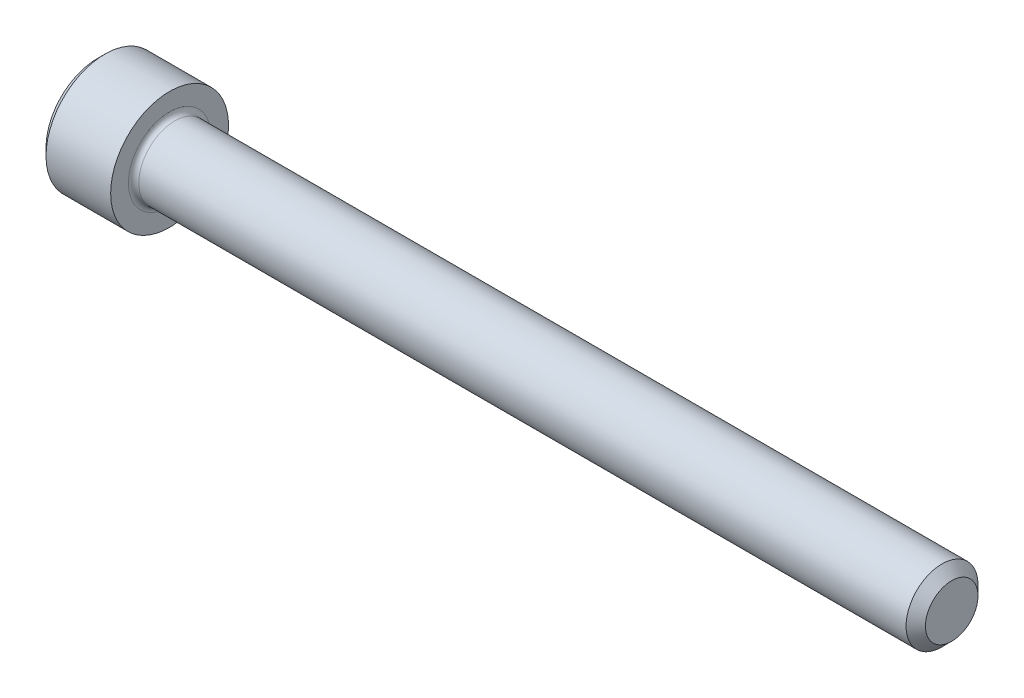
from build123d import *

# Parameters (mm, degrees)
FILLET1_R   = 0.254
HEX_2_DEPTH = 1.6256


with BuildPart() as part:
    # BodySke → Base-Revolve (revolve)
    with BuildSketch(Plane.XY, mode=Mode.PRIVATE) as base_revolve_sk:
        Polygon((0, 0), (0, 2.5146), (0.3556, 2.8702), (3.5052, 2.8702), (3.5052, 1.7526), (41.13276, 1.7526), (41.6052, 1.28016), (41.6052, 0), align=None)
    revolve(base_revolve_sk.sketch.rotate(Axis((-31.75, 0, 0), (1, 0, 0)), 90), axis=Axis((-31.75, 0, 0), (1, 0, 0)))

    # Fillet1
    fillet1_edges = [part.edges().sort_by_distance(p)[0] for p in [
        (3.5052, 0, -1.7526),
    ]]
    fillet(fillet1_edges, radius=FILLET1_R)

    # Sketch2 → Hex-PreBroach (revolve, cut)
    with BuildSketch(Plane.XY, mode=Mode.PRIVATE) as hex_prebroach_sk:
        Polygon((0, 1.3843), (1.6256, 1.3843), (2.424825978, 0), (0, 0), align=None)
    revolve(hex_prebroach_sk.sketch.rotate(Axis((0, 0, 0), (1, 0, 0)), 90), axis=Axis((0, 0, 0), (1, 0, 0)), mode=Mode.SUBTRACT)

    # Sketch3 → Hex 2 (cut)
    with BuildSketch(Plane(origin=(0, 0, 0), x_dir=(0, 0.500000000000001, 0.866025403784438), z_dir=(-1, 0, 0))):
        Polygon((0.799225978, 1.3843), (-0.799225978, 1.3843), (-1.598451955, 0), (-0.799225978, -1.3843), (0.799225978, -1.3843), (1.598451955, 0), align=None)
    extrude(amount=-HEX_2_DEPTH, mode=Mode.SUBTRACT)


solid = part.part
